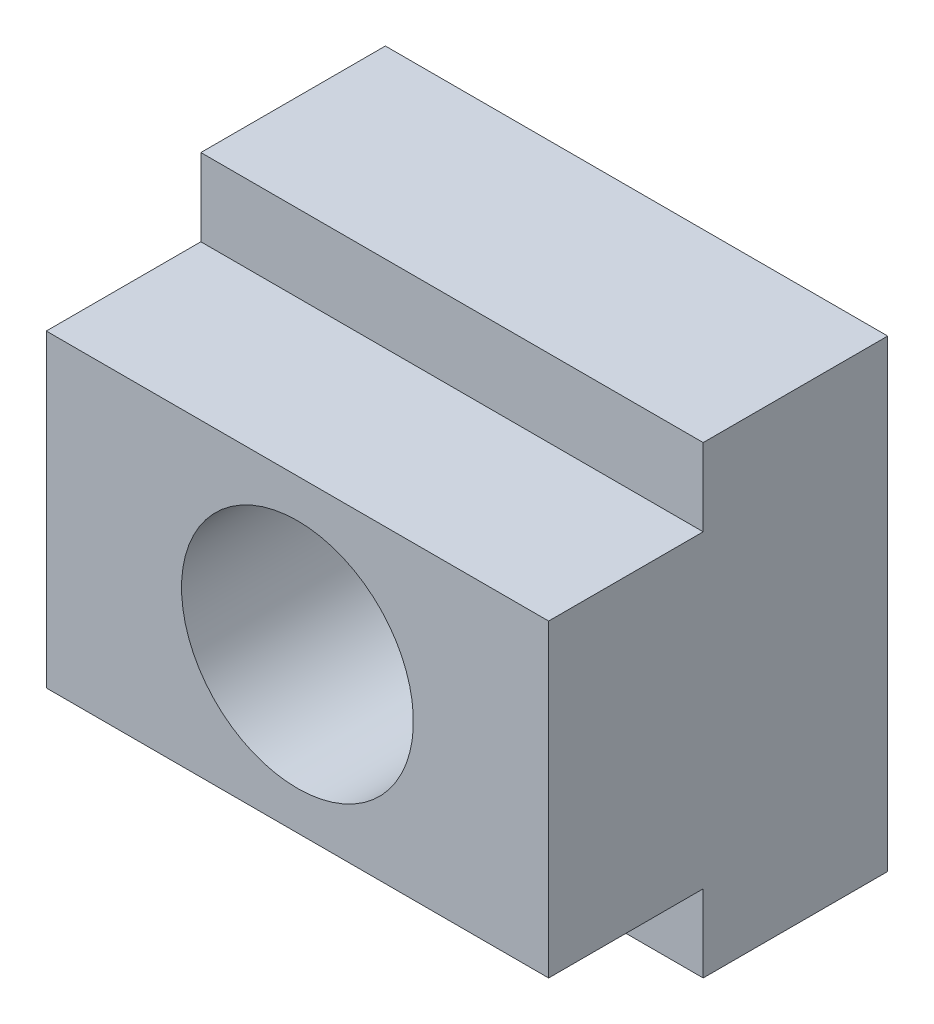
ISO-10303-21;
HEADER;
FILE_DESCRIPTION(('STEP AP214'),'2;1');
FILE_NAME('part.step','',(''),(''),'','','');
FILE_SCHEMA(('AUTOMOTIVE_DESIGN { 1 0 10303 214 1 1 1 1 }'));
ENDSEC;
DATA;
#1=APPLICATION_CONTEXT('core data for automotive mechanical design processes');
#2=APPLICATION_PROTOCOL_DEFINITION('international standard','automotive_design',2000,#1);
#3=PRODUCT_CONTEXT('',#1,'mechanical');
#4=PRODUCT('Part','Part','',(#3));
#5=PRODUCT_RELATED_PRODUCT_CATEGORY('part','',(#4));
#6=PRODUCT_DEFINITION_FORMATION('','',#4);
#7=PRODUCT_DEFINITION_CONTEXT('part definition',#1,'design');
#8=PRODUCT_DEFINITION('design','',#6,#7);
#9=PRODUCT_DEFINITION_SHAPE('','',#8);
#10=(LENGTH_UNIT() NAMED_UNIT(*) SI_UNIT(.MILLI.,.METRE.));
#11=(NAMED_UNIT(*) PLANE_ANGLE_UNIT() SI_UNIT($,.RADIAN.));
#12=(NAMED_UNIT(*) SI_UNIT($,.STERADIAN.) SOLID_ANGLE_UNIT());
#13=UNCERTAINTY_MEASURE_WITH_UNIT(LENGTH_MEASURE(1.E-05),#10,'distance_accuracy_value','');
#14=(GEOMETRIC_REPRESENTATION_CONTEXT(3) GLOBAL_UNCERTAINTY_ASSIGNED_CONTEXT((#13)) GLOBAL_UNIT_ASSIGNED_CONTEXT((#10,
#11,#12)) REPRESENTATION_CONTEXT('',''));
#15=CARTESIAN_POINT('',(0.,0.,0.));
#16=DIRECTION('',(0.,0.,1.));
#17=DIRECTION('',(1.,0.,0.));
#18=AXIS2_PLACEMENT_3D('',#15,#16,#17);
#19=CARTESIAN_POINT('',(13.,-12.,0.));
#20=DIRECTION('',(0.,0.,1.));
#21=DIRECTION('',(0.,1.,0.));
#22=AXIS2_PLACEMENT_3D('',#19,#20,#21);
#23=PLANE('',#22);
#24=DIRECTION('',(0.,1.,0.));
#25=VECTOR('',#24,1.);
#26=CARTESIAN_POINT('',(-13.,-5.4585435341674,0.));
#27=LINE('',#26,#25);
#28=CARTESIAN_POINT('',(-13.,-12.,0.));
#29=VERTEX_POINT('',#28);
#30=CARTESIAN_POINT('',(-13.,-8.,0.));
#31=VERTEX_POINT('',#30);
#32=EDGE_CURVE('E92',#29,#31,#27,.T.);
#33=ORIENTED_EDGE('',*,*,#32,.F.);
#34=DIRECTION('',(-1.,0.,0.));
#35=VECTOR('',#34,1.);
#36=CARTESIAN_POINT('',(13.,-12.,0.));
#37=LINE('',#36,#35);
#38=CARTESIAN_POINT('',(13.,-12.,0.));
#39=VERTEX_POINT('',#38);
#40=EDGE_CURVE('E79',#39,#29,#37,.T.);
#41=ORIENTED_EDGE('',*,*,#40,.F.);
#42=DIRECTION('',(0.,1.,0.));
#43=VECTOR('',#42,1.);
#44=CARTESIAN_POINT('',(13.,-5.4585435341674,0.));
#45=LINE('',#44,#43);
#46=CARTESIAN_POINT('',(13.,-8.,0.));
#47=VERTEX_POINT('',#46);
#48=EDGE_CURVE('E115',#47,#39,#45,.F.);
#49=ORIENTED_EDGE('',*,*,#48,.F.);
#50=DIRECTION('',(-1.,0.,0.));
#51=VECTOR('',#50,1.);
#52=CARTESIAN_POINT('',(13.,-8.,0.));
#53=LINE('',#52,#51);
#54=EDGE_CURVE('E98',#31,#47,#53,.F.);
#55=ORIENTED_EDGE('',*,*,#54,.F.);
#56=EDGE_LOOP('',(#33,#41,#49,#55));
#57=FACE_BOUND('',#56,.T.);
#58=ADVANCED_FACE('F14',(#57),#23,.T.);
#59=CARTESIAN_POINT('',(13.,12.,0.));
#60=DIRECTION('',(0.,0.,-1.));
#61=DIRECTION('',(0.,-1.,0.));
#62=AXIS2_PLACEMENT_3D('',#59,#60,#61);
#63=PLANE('',#62);
#64=DIRECTION('',(-1.,0.,0.));
#65=VECTOR('',#64,1.);
#66=CARTESIAN_POINT('',(13.,12.,0.));
#67=LINE('',#66,#65);
#68=CARTESIAN_POINT('',(13.,12.,0.));
#69=VERTEX_POINT('',#68);
#70=CARTESIAN_POINT('',(-13.,12.,0.));
#71=VERTEX_POINT('',#70);
#72=EDGE_CURVE('E17',#69,#71,#67,.T.);
#73=ORIENTED_EDGE('',*,*,#72,.T.);
#74=DIRECTION('',(0.,1.,0.));
#75=VECTOR('',#74,1.);
#76=CARTESIAN_POINT('',(-13.,-5.4585435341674,0.));
#77=LINE('',#76,#75);
#78=CARTESIAN_POINT('',(-13.,8.,0.));
#79=VERTEX_POINT('',#78);
#80=EDGE_CURVE('E73',#79,#71,#77,.T.);
#81=ORIENTED_EDGE('',*,*,#80,.F.);
#82=DIRECTION('',(-1.,0.,0.));
#83=VECTOR('',#82,1.);
#84=CARTESIAN_POINT('',(13.,8.,0.));
#85=LINE('',#84,#83);
#86=CARTESIAN_POINT('',(13.,8.,0.));
#87=VERTEX_POINT('',#86);
#88=EDGE_CURVE('E120',#79,#87,#85,.F.);
#89=ORIENTED_EDGE('',*,*,#88,.T.);
#90=DIRECTION('',(0.,1.,0.));
#91=VECTOR('',#90,1.);
#92=CARTESIAN_POINT('',(13.,-5.4585435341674,0.));
#93=LINE('',#92,#91);
#94=EDGE_CURVE('E110',#69,#87,#93,.F.);
#95=ORIENTED_EDGE('',*,*,#94,.F.);
#96=EDGE_LOOP('',(#73,#81,#89,#95));
#97=FACE_BOUND('',#96,.T.);
#98=ADVANCED_FACE('F148',(#97),#63,.F.);
#99=CARTESIAN_POINT('',(13.,12.,-9.54992877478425));
#100=DIRECTION('',(0.,-1.,0.));
#101=DIRECTION('',(0.,0.,1.));
#102=AXIS2_PLACEMENT_3D('',#99,#100,#101);
#103=PLANE('',#102);
#104=DIRECTION('',(-1.,0.,0.));
#105=VECTOR('',#104,1.);
#106=CARTESIAN_POINT('',(13.,12.,-9.54992877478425));
#107=LINE('',#106,#105);
#108=CARTESIAN_POINT('',(-13.,12.,-9.54992877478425));
#109=VERTEX_POINT('',#108);
#110=CARTESIAN_POINT('',(13.,12.,-9.54992877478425));
#111=VERTEX_POINT('',#110);
#112=EDGE_CURVE('E126',#109,#111,#107,.F.);
#113=ORIENTED_EDGE('',*,*,#112,.F.);
#114=DIRECTION('',(0.,0.,1.));
#115=VECTOR('',#114,1.);
#116=CARTESIAN_POINT('',(-13.,12.,-1.31642085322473));
#117=LINE('',#116,#115);
#118=EDGE_CURVE('E100',#71,#109,#117,.F.);
#119=ORIENTED_EDGE('',*,*,#118,.F.);
#120=ORIENTED_EDGE('',*,*,#72,.F.);
#121=DIRECTION('',(0.,0.,-1.));
#122=VECTOR('',#121,1.);
#123=CARTESIAN_POINT('',(13.,12.,-1.31642085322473));
#124=LINE('',#123,#122);
#125=EDGE_CURVE('E107',#111,#69,#124,.F.);
#126=ORIENTED_EDGE('',*,*,#125,.F.);
#127=EDGE_LOOP('',(#113,#119,#120,#126));
#128=FACE_BOUND('',#127,.T.);
#129=ADVANCED_FACE('F153',(#128),#103,.F.);
#130=CARTESIAN_POINT('',(13.,-12.,-9.54992877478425));
#131=DIRECTION('',(0.,-1.,0.));
#132=DIRECTION('',(0.,0.,1.));
#133=AXIS2_PLACEMENT_3D('',#130,#131,#132);
#134=PLANE('',#133);
#135=DIRECTION('',(0.,0.,1.));
#136=VECTOR('',#135,1.);
#137=CARTESIAN_POINT('',(-13.,-12.,-1.31642085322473));
#138=LINE('',#137,#136);
#139=CARTESIAN_POINT('',(-13.,-12.,-9.54992877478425));
#140=VERTEX_POINT('',#139);
#141=EDGE_CURVE('E83',#140,#29,#138,.T.);
#142=ORIENTED_EDGE('',*,*,#141,.F.);
#143=DIRECTION('',(-1.,0.,0.));
#144=VECTOR('',#143,1.);
#145=CARTESIAN_POINT('',(13.,-12.,-9.54992877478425));
#146=LINE('',#145,#144);
#147=CARTESIAN_POINT('',(13.,-12.,-9.54992877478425));
#148=VERTEX_POINT('',#147);
#149=EDGE_CURVE('E131',#148,#140,#146,.T.);
#150=ORIENTED_EDGE('',*,*,#149,.F.);
#151=DIRECTION('',(0.,0.,-1.));
#152=VECTOR('',#151,1.);
#153=CARTESIAN_POINT('',(13.,-12.,-1.31642085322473));
#154=LINE('',#153,#152);
#155=EDGE_CURVE('E85',#39,#148,#154,.T.);
#156=ORIENTED_EDGE('',*,*,#155,.F.);
#157=ORIENTED_EDGE('',*,*,#40,.T.);
#158=EDGE_LOOP('',(#142,#150,#156,#157));
#159=FACE_BOUND('',#158,.T.);
#160=ADVANCED_FACE('F81',(#159),#134,.T.);
#161=CARTESIAN_POINT('',(-13.,-5.4585435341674,-1.31642085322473));
#162=DIRECTION('',(-1.,0.,0.));
#163=DIRECTION('',(0.,0.,1.));
#164=AXIS2_PLACEMENT_3D('',#161,#162,#163);
#165=PLANE('',#164);
#166=ORIENTED_EDGE('',*,*,#80,.T.);
#167=ORIENTED_EDGE('',*,*,#118,.T.);
#168=DIRECTION('',(0.,-1.,0.));
#169=VECTOR('',#168,1.);
#170=CARTESIAN_POINT('',(-13.,0.,-9.54992877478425));
#171=LINE('',#170,#169);
#172=EDGE_CURVE('E95',#140,#109,#171,.F.);
#173=ORIENTED_EDGE('',*,*,#172,.F.);
#174=ORIENTED_EDGE('',*,*,#141,.T.);
#175=ORIENTED_EDGE('',*,*,#32,.T.);
#176=DIRECTION('',(0.,0.,1.));
#177=VECTOR('',#176,1.);
#178=CARTESIAN_POINT('',(-13.,-8.,0.));
#179=LINE('',#178,#177);
#180=CARTESIAN_POINT('',(-13.,-8.,8.));
#181=VERTEX_POINT('',#180);
#182=EDGE_CURVE('E104',#181,#31,#179,.F.);
#183=ORIENTED_EDGE('',*,*,#182,.F.);
#184=DIRECTION('',(0.,1.,0.));
#185=VECTOR('',#184,1.);
#186=CARTESIAN_POINT('',(-13.,-8.,8.));
#187=LINE('',#186,#185);
#188=CARTESIAN_POINT('',(-13.,8.,8.));
#189=VERTEX_POINT('',#188);
#190=EDGE_CURVE('E133',#189,#181,#187,.F.);
#191=ORIENTED_EDGE('',*,*,#190,.F.);
#192=DIRECTION('',(0.,0.,1.));
#193=VECTOR('',#192,1.);
#194=CARTESIAN_POINT('',(-13.,8.,0.));
#195=LINE('',#194,#193);
#196=EDGE_CURVE('E118',#189,#79,#195,.F.);
#197=ORIENTED_EDGE('',*,*,#196,.T.);
#198=EDGE_LOOP('',(#166,#167,#173,#174,#175,#183,#191,#197));
#199=FACE_BOUND('',#198,.T.);
#200=ADVANCED_FACE('F90',(#199),#165,.T.);
#201=CARTESIAN_POINT('',(13.,-8.,0.));
#202=DIRECTION('',(0.,-1.,0.));
#203=DIRECTION('',(0.,0.,1.));
#204=AXIS2_PLACEMENT_3D('',#201,#202,#203);
#205=PLANE('',#204);
#206=ORIENTED_EDGE('',*,*,#182,.T.);
#207=ORIENTED_EDGE('',*,*,#54,.T.);
#208=DIRECTION('',(0.,0.,-1.));
#209=VECTOR('',#208,1.);
#210=CARTESIAN_POINT('',(13.,-8.,-1.31642085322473));
#211=LINE('',#210,#209);
#212=CARTESIAN_POINT('',(13.,-8.,8.));
#213=VERTEX_POINT('',#212);
#214=EDGE_CURVE('E112',#213,#47,#211,.T.);
#215=ORIENTED_EDGE('',*,*,#214,.F.);
#216=DIRECTION('',(-1.,0.,0.));
#217=VECTOR('',#216,1.);
#218=CARTESIAN_POINT('',(13.,-8.,8.));
#219=LINE('',#218,#217);
#220=EDGE_CURVE('E135',#181,#213,#219,.F.);
#221=ORIENTED_EDGE('',*,*,#220,.F.);
#222=EDGE_LOOP('',(#206,#207,#215,#221));
#223=FACE_BOUND('',#222,.T.);
#224=ADVANCED_FACE('F162',(#223),#205,.T.);
#225=CARTESIAN_POINT('',(13.,-5.4585435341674,-1.31642085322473));
#226=DIRECTION('',(1.,0.,0.));
#227=DIRECTION('',(0.,0.,-1.));
#228=AXIS2_PLACEMENT_3D('',#225,#226,#227);
#229=PLANE('',#228);
#230=ORIENTED_EDGE('',*,*,#48,.T.);
#231=ORIENTED_EDGE('',*,*,#155,.T.);
#232=DIRECTION('',(0.,-1.,0.));
#233=VECTOR('',#232,1.);
#234=CARTESIAN_POINT('',(13.,0.,-9.54992877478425));
#235=LINE('',#234,#233);
#236=EDGE_CURVE('E128',#111,#148,#235,.T.);
#237=ORIENTED_EDGE('',*,*,#236,.F.);
#238=ORIENTED_EDGE('',*,*,#125,.T.);
#239=ORIENTED_EDGE('',*,*,#94,.T.);
#240=DIRECTION('',(0.,0.,1.));
#241=VECTOR('',#240,1.);
#242=CARTESIAN_POINT('',(13.,8.,0.));
#243=LINE('',#242,#241);
#244=CARTESIAN_POINT('',(13.,8.,8.));
#245=VERTEX_POINT('',#244);
#246=EDGE_CURVE('E123',#87,#245,#243,.T.);
#247=ORIENTED_EDGE('',*,*,#246,.T.);
#248=DIRECTION('',(0.,1.,0.));
#249=VECTOR('',#248,1.);
#250=CARTESIAN_POINT('',(13.,-8.,8.));
#251=LINE('',#250,#249);
#252=EDGE_CURVE('E23',#213,#245,#251,.T.);
#253=ORIENTED_EDGE('',*,*,#252,.F.);
#254=ORIENTED_EDGE('',*,*,#214,.T.);
#255=EDGE_LOOP('',(#230,#231,#237,#238,#239,#247,#253,#254));
#256=FACE_BOUND('',#255,.T.);
#257=ADVANCED_FACE('F158',(#256),#229,.T.);
#258=CARTESIAN_POINT('',(13.,8.,0.));
#259=DIRECTION('',(0.,-1.,0.));
#260=DIRECTION('',(0.,0.,1.));
#261=AXIS2_PLACEMENT_3D('',#258,#259,#260);
#262=PLANE('',#261);
#263=ORIENTED_EDGE('',*,*,#88,.F.);
#264=ORIENTED_EDGE('',*,*,#196,.F.);
#265=DIRECTION('',(-1.,0.,0.));
#266=VECTOR('',#265,1.);
#267=CARTESIAN_POINT('',(13.,8.,8.));
#268=LINE('',#267,#266);
#269=EDGE_CURVE('E9',#245,#189,#268,.T.);
#270=ORIENTED_EDGE('',*,*,#269,.F.);
#271=ORIENTED_EDGE('',*,*,#246,.F.);
#272=EDGE_LOOP('',(#263,#264,#270,#271));
#273=FACE_BOUND('',#272,.T.);
#274=ADVANCED_FACE('F168',(#273),#262,.F.);
#275=CARTESIAN_POINT('',(13.,0.,-9.54992877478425));
#276=DIRECTION('',(0.,0.,-1.));
#277=DIRECTION('',(0.,-1.,0.));
#278=AXIS2_PLACEMENT_3D('',#275,#276,#277);
#279=PLANE('',#278);
#280=CARTESIAN_POINT('',(0.,0.,-9.54992877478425));
#281=DIRECTION('',(0.,0.,1.));
#282=DIRECTION('',(0.,1.,0.));
#283=AXIS2_PLACEMENT_3D('',#280,#281,#282);
#284=CIRCLE('',#283,6.);
#285=CARTESIAN_POINT('',(0.,6.,-9.54992877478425));
#286=VERTEX_POINT('',#285);
#287=EDGE_CURVE('E141',#286,#286,#284,.T.);
#288=ORIENTED_EDGE('',*,*,#287,.T.);
#289=EDGE_LOOP('',(#288));
#290=FACE_BOUND('',#289,.T.);
#291=ORIENTED_EDGE('',*,*,#236,.T.);
#292=ORIENTED_EDGE('',*,*,#149,.T.);
#293=ORIENTED_EDGE('',*,*,#172,.T.);
#294=ORIENTED_EDGE('',*,*,#112,.T.);
#295=EDGE_LOOP('',(#291,#292,#293,#294));
#296=FACE_BOUND('',#295,.T.);
#297=ADVANCED_FACE('F155',(#290,#296),#279,.T.);
#298=CARTESIAN_POINT('',(13.,-8.,8.));
#299=DIRECTION('',(0.,0.,1.));
#300=DIRECTION('',(0.,1.,0.));
#301=AXIS2_PLACEMENT_3D('',#298,#299,#300);
#302=PLANE('',#301);
#303=CARTESIAN_POINT('',(0.,0.,8.));
#304=DIRECTION('',(0.,0.,1.));
#305=DIRECTION('',(0.,1.,0.));
#306=AXIS2_PLACEMENT_3D('',#303,#304,#305);
#307=CIRCLE('',#306,6.);
#308=CARTESIAN_POINT('',(0.,6.,8.));
#309=VERTEX_POINT('',#308);
#310=EDGE_CURVE('E138',#309,#309,#307,.T.);
#311=ORIENTED_EDGE('',*,*,#310,.F.);
#312=EDGE_LOOP('',(#311));
#313=FACE_BOUND('',#312,.T.);
#314=ORIENTED_EDGE('',*,*,#252,.T.);
#315=ORIENTED_EDGE('',*,*,#269,.T.);
#316=ORIENTED_EDGE('',*,*,#190,.T.);
#317=ORIENTED_EDGE('',*,*,#220,.T.);
#318=EDGE_LOOP('',(#314,#315,#316,#317));
#319=FACE_BOUND('',#318,.T.);
#320=ADVANCED_FACE('F164',(#313,#319),#302,.T.);
#321=CARTESIAN_POINT('',(0.,0.,-9.54992877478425));
#322=DIRECTION('',(0.,0.,1.));
#323=DIRECTION('',(0.,1.,0.));
#324=AXIS2_PLACEMENT_3D('',#321,#322,#323);
#325=CYLINDRICAL_SURFACE('',#324,6.);
#326=ORIENTED_EDGE('',*,*,#287,.F.);
#327=EDGE_LOOP('',(#326));
#328=FACE_BOUND('',#327,.T.);
#329=ORIENTED_EDGE('',*,*,#310,.T.);
#330=EDGE_LOOP('',(#329));
#331=FACE_BOUND('',#330,.T.);
#332=ADVANCED_FACE('F180',(#328,#331),#325,.F.);
#333=CLOSED_SHELL('',(#58,#98,#129,#160,#200,#224,#257,#274,#297,#320,#332));
#334=MANIFOLD_SOLID_BREP('B1',#333);
#335=ADVANCED_BREP_SHAPE_REPRESENTATION('',(#18,#334),#14);
#336=SHAPE_DEFINITION_REPRESENTATION(#9,#335);
ENDSEC;
END-ISO-10303-21;
